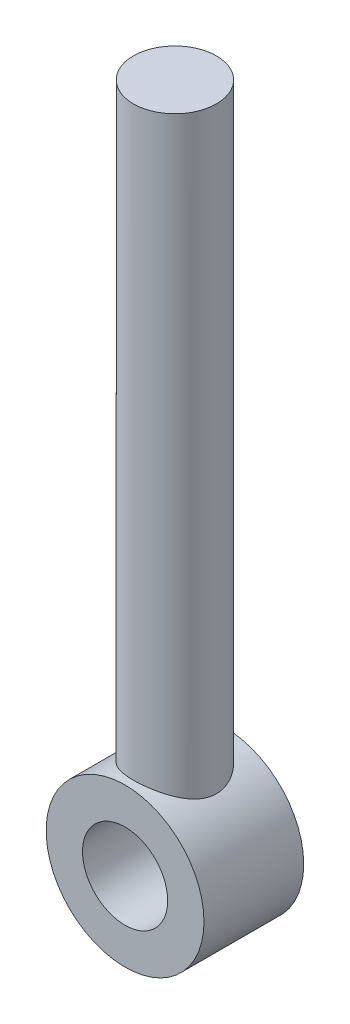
ISO-10303-21;
HEADER;
FILE_DESCRIPTION(('STEP AP214'),'2;1');
FILE_NAME('part.step','',(''),(''),'','','');
FILE_SCHEMA(('AUTOMOTIVE_DESIGN { 1 0 10303 214 1 1 1 1 }'));
ENDSEC;
DATA;
#1=APPLICATION_CONTEXT('core data for automotive mechanical design processes');
#2=APPLICATION_PROTOCOL_DEFINITION('international standard','automotive_design',2000,#1);
#3=PRODUCT_CONTEXT('',#1,'mechanical');
#4=PRODUCT('Part','Part','',(#3));
#5=PRODUCT_RELATED_PRODUCT_CATEGORY('part','',(#4));
#6=PRODUCT_DEFINITION_FORMATION('','',#4);
#7=PRODUCT_DEFINITION_CONTEXT('part definition',#1,'design');
#8=PRODUCT_DEFINITION('design','',#6,#7);
#9=PRODUCT_DEFINITION_SHAPE('','',#8);
#10=(LENGTH_UNIT() NAMED_UNIT(*) SI_UNIT(.MILLI.,.METRE.));
#11=(NAMED_UNIT(*) PLANE_ANGLE_UNIT() SI_UNIT($,.RADIAN.));
#12=(NAMED_UNIT(*) SI_UNIT($,.STERADIAN.) SOLID_ANGLE_UNIT());
#13=UNCERTAINTY_MEASURE_WITH_UNIT(LENGTH_MEASURE(1.E-05),#10,'distance_accuracy_value','');
#14=(GEOMETRIC_REPRESENTATION_CONTEXT(3) GLOBAL_UNCERTAINTY_ASSIGNED_CONTEXT((#13)) GLOBAL_UNIT_ASSIGNED_CONTEXT((#10,
#11,#12)) REPRESENTATION_CONTEXT('',''));
#15=CARTESIAN_POINT('',(0.,0.,0.));
#16=DIRECTION('',(0.,0.,1.));
#17=DIRECTION('',(1.,0.,0.));
#18=AXIS2_PLACEMENT_3D('',#15,#16,#17);
#19=CARTESIAN_POINT('',(0.,-12.7,-9.525));
#20=DIRECTION('',(0.,0.,1.));
#21=DIRECTION('',(1.,0.,0.));
#22=AXIS2_PLACEMENT_3D('',#19,#20,#21);
#23=CYLINDRICAL_SURFACE('',#22,15.08125);
#24=CARTESIAN_POINT('',(0.,-12.7,9.525));
#25=DIRECTION('',(0.,0.,1.));
#26=DIRECTION('',(1.,0.,0.));
#27=AXIS2_PLACEMENT_3D('',#24,#25,#26);
#28=CIRCLE('',#27,15.08125);
#29=CARTESIAN_POINT('',(15.08125,-12.7,9.525));
#30=VERTEX_POINT('',#29);
#31=EDGE_CURVE('E54',#30,#30,#28,.T.);
#32=ORIENTED_EDGE('',*,*,#31,.F.);
#33=EDGE_LOOP('',(#32));
#34=FACE_BOUND('',#33,.T.);
#35=CARTESIAN_POINT('',(0.,-12.7,-9.525));
#36=DIRECTION('',(0.,0.,1.));
#37=DIRECTION('',(1.,0.,0.));
#38=AXIS2_PLACEMENT_3D('',#35,#36,#37);
#39=CIRCLE('',#38,15.08125);
#40=CARTESIAN_POINT('',(15.08125,-12.7,-9.525));
#41=VERTEX_POINT('',#40);
#42=EDGE_CURVE('E47',#41,#41,#39,.T.);
#43=ORIENTED_EDGE('',*,*,#42,.T.);
#44=EDGE_LOOP('',(#43));
#45=FACE_BOUND('',#44,.T.);
#46=CARTESIAN_POINT('',(0.,2.38124999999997,-7.9375));
#47=CARTESIAN_POINT('',(-0.207394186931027,2.38125040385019,-7.93750049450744));
#48=CARTESIAN_POINT('',(-0.414782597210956,2.37696275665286,-7.92936320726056));
#49=CARTESIAN_POINT('',(-0.828014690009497,2.35992263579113,-7.89691493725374));
#50=CARTESIAN_POINT('',(-1.03385778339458,2.34716708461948,-7.87259807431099));
#51=CARTESIAN_POINT('',(-1.44260073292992,2.31349757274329,-7.80805173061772));
#52=CARTESIAN_POINT('',(-1.64549681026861,2.29257395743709,-7.7678034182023));
#53=CARTESIAN_POINT('',(-2.04672691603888,2.24308855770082,-7.67185684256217));
#54=CARTESIAN_POINT('',(-2.24505904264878,2.2145236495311,-7.61615226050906));
#55=CARTESIAN_POINT('',(-2.63491366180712,2.15059475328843,-7.49018721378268));
#56=CARTESIAN_POINT('',(-2.82646261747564,2.11526170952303,-7.41999288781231));
#57=CARTESIAN_POINT('',(-3.20259508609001,2.03853448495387,-7.26558126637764));
#58=CARTESIAN_POINT('',(-3.38717606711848,1.99713812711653,-7.1813589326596));
#59=CARTESIAN_POINT('',(-3.92877765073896,1.86524976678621,-6.90881639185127));
#60=CARTESIAN_POINT('',(-4.27405558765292,1.76699022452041,-6.7004903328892));
#61=CARTESIAN_POINT('',(-4.94790708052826,1.55116303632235,-6.22126354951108));
#62=CARTESIAN_POINT('',(-5.27394005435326,1.43275593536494,-5.94717795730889));
#63=CARTESIAN_POINT('',(-5.72656002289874,1.25267514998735,-5.50049825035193));
#64=CARTESIAN_POINT('',(-5.87145684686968,1.19219018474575,-5.34555005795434));
#65=CARTESIAN_POINT('',(-6.14854891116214,1.07179123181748,-5.02436250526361));
#66=CARTESIAN_POINT('',(-6.28074192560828,1.01187734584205,-4.85812117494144));
#67=CARTESIAN_POINT('',(-6.54281317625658,0.888910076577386,-4.49989226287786));
#68=CARTESIAN_POINT('',(-6.67144914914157,0.826048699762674,-4.30692847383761));
#69=CARTESIAN_POINT('',(-6.91183439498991,0.704803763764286,-3.90952046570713));
#70=CARTESIAN_POINT('',(-7.02359075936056,0.646418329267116,-3.70508111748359));
#71=CARTESIAN_POINT('',(-7.22924412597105,0.536153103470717,-3.28579312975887));
#72=CARTESIAN_POINT('',(-7.32314701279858,0.484271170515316,-3.07094794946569));
#73=CARTESIAN_POINT('',(-7.49206601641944,0.389020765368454,-2.63212910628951));
#74=CARTESIAN_POINT('',(-7.56708444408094,0.345651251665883,-2.40815656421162));
#75=CARTESIAN_POINT('',(-7.6931561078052,0.271679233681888,-1.96687473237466));
#76=CARTESIAN_POINT('',(-7.74540656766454,0.240452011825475,-1.75001291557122));
#77=CARTESIAN_POINT('',(-7.83160147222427,0.188470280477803,-1.31143209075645));
#78=CARTESIAN_POINT('',(-7.86554678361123,0.167715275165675,-1.08971331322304));
#79=CARTESIAN_POINT('',(-7.91453790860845,0.137640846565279,-0.643651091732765));
#80=CARTESIAN_POINT('',(-7.92960310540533,0.128309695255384,-0.419310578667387));
#81=CARTESIAN_POINT('',(-7.9406227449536,0.121492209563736,0.0300080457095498));
#82=CARTESIAN_POINT('',(-7.93657938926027,0.124004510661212,0.254986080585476));
#83=CARTESIAN_POINT('',(-7.91132031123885,0.139598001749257,0.672716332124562));
#84=CARTESIAN_POINT('',(-7.89252309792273,0.151190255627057,0.865676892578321));
#85=CARTESIAN_POINT('',(-7.84098674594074,0.18269935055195,1.2491027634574));
#86=CARTESIAN_POINT('',(-7.80824306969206,0.202618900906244,1.43956724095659));
#87=CARTESIAN_POINT('',(-7.72921466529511,0.250114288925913,1.81666250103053));
#88=CARTESIAN_POINT('',(-7.68293100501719,0.277689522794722,2.00329358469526));
#89=CARTESIAN_POINT('',(-7.57730353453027,0.339644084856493,2.37173405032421));
#90=CARTESIAN_POINT('',(-7.51795447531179,0.374026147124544,2.55354146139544));
#91=CARTESIAN_POINT('',(-7.38529913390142,0.449425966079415,2.91534096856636));
#92=CARTESIAN_POINT('',(-7.31171123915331,0.490574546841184,3.09520227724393));
#93=CARTESIAN_POINT('',(-7.15205829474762,0.577817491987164,3.44811460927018));
#94=CARTESIAN_POINT('',(-7.06598912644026,0.623913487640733,3.62116336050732));
#95=CARTESIAN_POINT('',(-6.88196115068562,0.719891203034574,3.95975400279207));
#96=CARTESIAN_POINT('',(-6.78400034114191,0.769773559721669,4.12529462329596));
#97=CARTESIAN_POINT('',(-6.57674863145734,0.872171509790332,4.44827008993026));
#98=CARTESIAN_POINT('',(-6.4674570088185,0.924687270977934,4.60570441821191));
#99=CARTESIAN_POINT('',(-6.22168528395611,1.03883585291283,4.93379435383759));
#100=CARTESIAN_POINT('',(-6.08355065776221,1.10070067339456,5.10313285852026));
#101=CARTESIAN_POINT('',(-5.7938748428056,1.22479607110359,5.42978641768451));
#102=CARTESIAN_POINT('',(-5.64233293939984,1.28702666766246,5.58710083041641));
#103=CARTESIAN_POINT('',(-5.32646473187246,1.41033769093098,5.88900925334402));
#104=CARTESIAN_POINT('',(-5.16213193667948,1.47141751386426,6.03359672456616));
#105=CARTESIAN_POINT('',(-4.82146501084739,1.59091194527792,6.30915082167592));
#106=CARTESIAN_POINT('',(-4.6451292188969,1.64932618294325,6.44011555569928));
#107=CARTESIAN_POINT('',(-4.2709149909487,1.76526522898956,6.69456893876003));
#108=CARTESIAN_POINT('',(-4.07238159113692,1.82254982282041,6.81720675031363));
#109=CARTESIAN_POINT('',(-3.66406217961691,1.93090355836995,7.04508248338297));
#110=CARTESIAN_POINT('',(-3.45428133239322,1.98197551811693,7.15032830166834));
#111=CARTESIAN_POINT('',(-3.02484600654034,2.07642422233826,7.34230893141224));
#112=CARTESIAN_POINT('',(-2.80519594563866,2.11980436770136,7.42905192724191));
#113=CARTESIAN_POINT('',(-2.35760575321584,2.19756235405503,7.58298003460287));
#114=CARTESIAN_POINT('',(-2.12966669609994,2.23194135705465,7.65016767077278));
#115=CARTESIAN_POINT('',(-1.68790767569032,2.28800105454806,7.75899170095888));
#116=CARTESIAN_POINT('',(-1.47462238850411,2.31053601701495,7.80236259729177));
#117=CARTESIAN_POINT('',(-1.04446183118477,2.34658661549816,7.87149588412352));
#118=CARTESIAN_POINT('',(-0.827586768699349,2.36010277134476,7.89725928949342));
#119=CARTESIAN_POINT('',(-0.392170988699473,2.37772391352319,7.93081121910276));
#120=CARTESIAN_POINT('',(-0.173631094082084,2.38183328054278,7.93860811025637));
#121=CARTESIAN_POINT('',(0.263312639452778,2.38053339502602,7.93613857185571));
#122=CARTESIAN_POINT('',(0.481716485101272,2.37512465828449,7.92587312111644));
#123=CARTESIAN_POINT('',(0.897313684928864,2.35584024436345,7.88912825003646));
#124=CARTESIAN_POINT('',(1.09467954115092,2.34275301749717,7.8641579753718));
#125=CARTESIAN_POINT('',(1.48642818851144,2.30910697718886,7.7996061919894));
#126=CARTESIAN_POINT('',(1.68080995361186,2.288545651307,7.76001976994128));
#127=CARTESIAN_POINT('',(2.06518186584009,2.24043614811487,7.66668338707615));
#128=CARTESIAN_POINT('',(2.25517342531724,2.2128902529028,7.61293805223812));
#129=CARTESIAN_POINT('',(2.62976260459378,2.15141397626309,7.49179713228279));
#130=CARTESIAN_POINT('',(2.81435809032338,2.11748110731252,7.42439622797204));
#131=CARTESIAN_POINT('',(3.18170393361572,2.04302748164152,7.27468162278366));
#132=CARTESIAN_POINT('',(3.3642880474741,2.00236116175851,7.1920323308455));
#133=CARTESIAN_POINT('',(3.72176867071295,1.91596427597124,7.01372091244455));
#134=CARTESIAN_POINT('',(3.89666255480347,1.87023199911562,6.91805438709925));
#135=CARTESIAN_POINT('',(4.40854109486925,1.72685604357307,6.61259821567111));
#136=CARTESIAN_POINT('',(4.73292149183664,1.62299134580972,6.38427020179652));
#137=CARTESIAN_POINT('',(5.37484577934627,1.39549969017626,5.85707040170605));
#138=CARTESIAN_POINT('',(5.6880369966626,1.27094446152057,5.55329138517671));
#139=CARTESIAN_POINT('',(6.11761900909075,1.08562023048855,5.06222173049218));
#140=CARTESIAN_POINT('',(6.25420466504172,1.02404862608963,4.89248275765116));
#141=CARTESIAN_POINT('',(6.51333581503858,0.902976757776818,4.54179172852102));
#142=CARTESIAN_POINT('',(6.6358790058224,0.843476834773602,4.36083784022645));
#143=CARTESIAN_POINT('',(6.87340686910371,0.724572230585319,3.97672861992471));
#144=CARTESIAN_POINT('',(6.98741688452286,0.665413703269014,3.77289316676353));
#145=CARTESIAN_POINT('',(7.19756616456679,0.553426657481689,3.35465065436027));
#146=CARTESIAN_POINT('',(7.29371405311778,0.50059508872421,3.14024876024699));
#147=CARTESIAN_POINT('',(7.46705987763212,0.403320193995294,2.70228305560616));
#148=CARTESIAN_POINT('',(7.5442745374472,0.358869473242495,2.47872753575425));
#149=CARTESIAN_POINT('',(7.67878518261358,0.280233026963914,2.02394697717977));
#150=CARTESIAN_POINT('',(7.73608462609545,0.246045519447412,1.79272327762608));
#151=CARTESIAN_POINT('',(7.82523454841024,0.192332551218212,1.34758159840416));
#152=CARTESIAN_POINT('',(7.85902730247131,0.171699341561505,1.13418553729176));
#153=CARTESIAN_POINT('',(7.90912147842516,0.140980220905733,0.704593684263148));
#154=CARTESIAN_POINT('',(7.92542414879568,0.130893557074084,0.488398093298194));
#155=CARTESIAN_POINT('',(7.94026335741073,0.121715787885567,0.0552791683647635));
#156=CARTESIAN_POINT('',(7.93880925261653,0.122618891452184,-0.161643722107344));
#157=CARTESIAN_POINT('',(7.91818152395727,0.135367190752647,-0.594311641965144));
#158=CARTESIAN_POINT('',(7.89900896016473,0.147211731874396,-0.810056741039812));
#159=CARTESIAN_POINT('',(7.84650775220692,0.17933349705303,-1.21354220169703));
#160=CARTESIAN_POINT('',(7.81508117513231,0.198471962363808,-1.40162570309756));
#161=CARTESIAN_POINT('',(7.7390047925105,0.244260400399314,-1.77422610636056));
#162=CARTESIAN_POINT('',(7.6943506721,0.270912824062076,-1.95874182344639));
#163=CARTESIAN_POINT('',(7.59229978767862,0.330908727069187,-2.32307353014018));
#164=CARTESIAN_POINT('',(7.53490439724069,0.364251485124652,-2.50289002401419));
#165=CARTESIAN_POINT('',(7.4078951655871,0.436686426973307,-2.85699488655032));
#166=CARTESIAN_POINT('',(7.33827648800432,0.475780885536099,-3.03128103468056));
#167=CARTESIAN_POINT('',(7.10209356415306,0.605563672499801,-3.56688597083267));
#168=CARTESIAN_POINT('',(6.91480321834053,0.704678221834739,-3.91725817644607));
#169=CARTESIAN_POINT('',(6.49213724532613,0.914395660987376,-4.58389307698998));
#170=CARTESIAN_POINT('',(6.2567357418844,1.02500471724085,-4.90013727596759));
#171=CARTESIAN_POINT('',(5.85300618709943,1.20007337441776,-5.36622673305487));
#172=CARTESIAN_POINT('',(5.69931167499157,1.26394393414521,-5.52918943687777));
#173=CARTESIAN_POINT('',(5.37849708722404,1.39062003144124,-5.84172864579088));
#174=CARTESIAN_POINT('',(5.21138102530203,1.45342588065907,-5.9913091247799));
#175=CARTESIAN_POINT('',(4.86436402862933,1.5764135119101,-6.27633069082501));
#176=CARTESIAN_POINT('',(4.68445328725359,1.63659322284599,-6.41176073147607));
#177=CARTESIAN_POINT('',(4.31280547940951,1.75274058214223,-6.66741965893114));
#178=CARTESIAN_POINT('',(4.1210670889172,1.80870775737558,-6.78764683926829));
#179=CARTESIAN_POINT('',(3.72274660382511,1.91604134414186,-7.01417308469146));
#180=CARTESIAN_POINT('',(3.51594044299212,1.96728957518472,-7.12013515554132));
#181=CARTESIAN_POINT('',(3.09250050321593,2.06237088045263,-7.31399569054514));
#182=CARTESIAN_POINT('',(2.87587162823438,2.10620760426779,-7.40190304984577));
#183=CARTESIAN_POINT('',(2.43472531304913,2.18510369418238,-7.55848415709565));
#184=CARTESIAN_POINT('',(2.21022513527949,2.22018104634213,-7.62719735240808));
#185=CARTESIAN_POINT('',(1.75488650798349,2.28055967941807,-7.74464426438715));
#186=CARTESIAN_POINT('',(1.5240517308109,2.30586650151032,-7.79338930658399));
#187=CARTESIAN_POINT('',(1.07831022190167,2.34416722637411,-7.86687107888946));
#188=CARTESIAN_POINT('',(0.863760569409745,2.35803937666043,-7.89332477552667));
#189=CARTESIAN_POINT('',(0.432805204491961,2.37658063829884,-7.92863914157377));
#190=CARTESIAN_POINT('',(0.21639945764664,2.38124957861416,-7.93749948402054));
#191=CARTESIAN_POINT('',(0.,2.38124999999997,-7.9375));
#192=B_SPLINE_CURVE_WITH_KNOTS('',3,(#46,#47,#48,#49,#50,#51,#52,#53,#54,#55,#56,#57,#58,#59,
#60,#61,#62,#63,#64,#65,#66,#67,#68,#69,#70,#71,#72,#73,#74,#75,#76,#77,#78,#79,#80,#81,#82,#83,
#84,#85,#86,#87,#88,#89,#90,#91,#92,#93,#94,#95,#96,#97,#98,#99,#100,#101,#102,#103,#104,#105,
#106,#107,#108,#109,#110,#111,#112,#113,#114,#115,#116,#117,#118,#119,#120,#121,#122,#123,#124,
#125,#126,#127,#128,#129,#130,#131,#132,#133,#134,#135,#136,#137,#138,#139,#140,#141,#142,#143,
#144,#145,#146,#147,#148,#149,#150,#151,#152,#153,#154,#155,#156,#157,#158,#159,#160,#161,#162,
#163,#164,#165,#166,#167,#168,#169,#170,#171,#172,#173,#174,#175,#176,#177,#178,#179,#180,#181,
#182,#183,#184,#185,#186,#187,#188,#189,#190,#191),.UNSPECIFIED.,.T.,.F.,(4,2,2,2,2,2,2,2,2,2,2,
2,2,2,2,2,2,2,2,2,2,2,2,2,2,2,2,2,2,2,2,2,2,2,2,2,2,2,2,2,2,2,2,2,2,2,2,2,2,2,2,2,2,2,2,2,2,2,2,
2,2,2,2,2,2,2,2,2,2,2,2,2,4),(0.,0.621970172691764,1.24416651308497,1.86710052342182,
2.4902895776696,3.11069459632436,3.73132292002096,4.97131934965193,6.29183494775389,
6.95308655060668,7.61445380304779,8.33440442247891,9.05405173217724,9.77346143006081,
10.4927830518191,11.1675188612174,11.8422227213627,12.5162333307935,13.1901662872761,
13.7721389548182,14.3543011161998,14.9364173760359,15.5187679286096,16.1140987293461,
16.7096264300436,17.3052545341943,17.9009206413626,18.5815488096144,19.2622132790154,
19.9432254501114,20.6243320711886,21.3442373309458,22.0638148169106,22.783073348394,
23.5022389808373,24.1577875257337,24.813298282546,25.4685037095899,26.1236736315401,
26.7210860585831,27.3186994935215,27.916117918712,28.5137695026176,29.1266165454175,
29.7396712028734,30.9651303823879,32.3202167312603,32.9988386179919,33.6775716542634,
34.3994208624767,35.1209206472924,35.8417808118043,36.5625157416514,37.2126905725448,
37.8628189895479,38.5126048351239,39.1623518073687,39.7366591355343,40.311154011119,
40.8855869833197,41.4602477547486,42.6835729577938,43.9075578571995,44.6056871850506,
45.3036085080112,46.0020706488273,46.7006111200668,47.4135065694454,48.1260499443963,
48.8371179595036,49.5477821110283,50.1967468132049,50.8457235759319),.UNSPECIFIED.);
#193=CARTESIAN_POINT('',(0.,2.38124999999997,-7.9375));
#194=VERTEX_POINT('',#193);
#195=EDGE_CURVE('E37',#194,#194,#192,.T.);
#196=ORIENTED_EDGE('',*,*,#195,.F.);
#197=EDGE_LOOP('',(#196));
#198=FACE_BOUND('',#197,.T.);
#199=ADVANCED_FACE('F32',(#34,#45,#198),#23,.T.);
#200=CARTESIAN_POINT('',(0.,-12.7,-9.525));
#201=DIRECTION('',(0.,0.,1.));
#202=DIRECTION('',(1.,0.,0.));
#203=AXIS2_PLACEMENT_3D('',#200,#201,#202);
#204=PLANE('',#203);
#205=CARTESIAN_POINT('',(0.,-12.7,-9.525));
#206=DIRECTION('',(0.,0.,1.));
#207=DIRECTION('',(1.,0.,0.));
#208=AXIS2_PLACEMENT_3D('',#205,#206,#207);
#209=CIRCLE('',#208,8.1359375);
#210=CARTESIAN_POINT('',(8.1359375,-12.7,-9.525));
#211=VERTEX_POINT('',#210);
#212=EDGE_CURVE('E51',#211,#211,#209,.T.);
#213=ORIENTED_EDGE('',*,*,#212,.T.);
#214=EDGE_LOOP('',(#213));
#215=FACE_BOUND('',#214,.T.);
#216=ORIENTED_EDGE('',*,*,#42,.F.);
#217=EDGE_LOOP('',(#216));
#218=FACE_BOUND('',#217,.T.);
#219=ADVANCED_FACE('F73',(#215,#218),#204,.F.);
#220=CARTESIAN_POINT('',(0.,-12.7,-9.525));
#221=DIRECTION('',(0.,0.,1.));
#222=DIRECTION('',(1.,0.,0.));
#223=AXIS2_PLACEMENT_3D('',#220,#221,#222);
#224=CYLINDRICAL_SURFACE('',#223,8.1359375);
#225=CARTESIAN_POINT('',(0.,-12.7,9.525));
#226=DIRECTION('',(0.,0.,1.));
#227=DIRECTION('',(1.,0.,0.));
#228=AXIS2_PLACEMENT_3D('',#225,#226,#227);
#229=CIRCLE('',#228,8.1359375);
#230=CARTESIAN_POINT('',(8.1359375,-12.7,9.525));
#231=VERTEX_POINT('',#230);
#232=EDGE_CURVE('E57',#231,#231,#229,.T.);
#233=CARTESIAN_POINT('',(8.1359375,-12.7,-9.525));
#234=CARTESIAN_POINT('',(8.1359375,-12.7,-9.3265625));
#235=CARTESIAN_POINT('',(8.1359375,-12.7,-9.128125));
#236=CARTESIAN_POINT('',(8.1359375,-12.7,-8.73125));
#237=CARTESIAN_POINT('',(8.1359375,-12.7,-8.5328125));
#238=CARTESIAN_POINT('',(8.1359375,-12.7,-8.1359375));
#239=CARTESIAN_POINT('',(8.1359375,-12.7,-7.9375));
#240=CARTESIAN_POINT('',(8.1359375,-12.7,-7.540625));
#241=CARTESIAN_POINT('',(8.1359375,-12.7,-7.3421875));
#242=CARTESIAN_POINT('',(8.1359375,-12.7,-6.9453125));
#243=CARTESIAN_POINT('',(8.1359375,-12.7,-6.746875));
#244=CARTESIAN_POINT('',(8.1359375,-12.7,-6.35));
#245=CARTESIAN_POINT('',(8.1359375,-12.7,-6.1515625));
#246=CARTESIAN_POINT('',(8.1359375,-12.7,-5.7546875));
#247=CARTESIAN_POINT('',(8.1359375,-12.7,-5.55625));
#248=CARTESIAN_POINT('',(8.1359375,-12.7,-5.159375));
#249=CARTESIAN_POINT('',(8.1359375,-12.7,-4.9609375));
#250=CARTESIAN_POINT('',(8.1359375,-12.7,-4.5640625));
#251=CARTESIAN_POINT('',(8.1359375,-12.7,-4.365625));
#252=CARTESIAN_POINT('',(8.1359375,-12.7,-3.96875));
#253=CARTESIAN_POINT('',(8.1359375,-12.7,-3.7703125));
#254=CARTESIAN_POINT('',(8.1359375,-12.7,-3.3734375));
#255=CARTESIAN_POINT('',(8.1359375,-12.7,-3.175));
#256=CARTESIAN_POINT('',(8.1359375,-12.7,-2.778125));
#257=CARTESIAN_POINT('',(8.1359375,-12.7,-2.5796875));
#258=CARTESIAN_POINT('',(8.1359375,-12.7,-2.1828125));
#259=CARTESIAN_POINT('',(8.1359375,-12.7,-1.984375));
#260=CARTESIAN_POINT('',(8.1359375,-12.7,-1.5875));
#261=CARTESIAN_POINT('',(8.1359375,-12.7,-1.3890625));
#262=CARTESIAN_POINT('',(8.1359375,-12.7,-0.992187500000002));
#263=CARTESIAN_POINT('',(8.1359375,-12.7,-0.793750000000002));
#264=CARTESIAN_POINT('',(8.1359375,-12.7,-0.396875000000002));
#265=CARTESIAN_POINT('',(8.1359375,-12.7,-0.198437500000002));
#266=CARTESIAN_POINT('',(8.1359375,-12.7,0.198437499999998));
#267=CARTESIAN_POINT('',(8.1359375,-12.7,0.396874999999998));
#268=CARTESIAN_POINT('',(8.1359375,-12.7,0.793749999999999));
#269=CARTESIAN_POINT('',(8.1359375,-12.7,0.992187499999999));
#270=CARTESIAN_POINT('',(8.1359375,-12.7,1.3890625));
#271=CARTESIAN_POINT('',(8.1359375,-12.7,1.5875));
#272=CARTESIAN_POINT('',(8.1359375,-12.7,1.984375));
#273=CARTESIAN_POINT('',(8.1359375,-12.7,2.1828125));
#274=CARTESIAN_POINT('',(8.1359375,-12.7,2.5796875));
#275=CARTESIAN_POINT('',(8.1359375,-12.7,2.778125));
#276=CARTESIAN_POINT('',(8.1359375,-12.7,3.175));
#277=CARTESIAN_POINT('',(8.1359375,-12.7,3.3734375));
#278=CARTESIAN_POINT('',(8.1359375,-12.7,3.7703125));
#279=CARTESIAN_POINT('',(8.1359375,-12.7,3.96875));
#280=CARTESIAN_POINT('',(8.1359375,-12.7,4.365625));
#281=CARTESIAN_POINT('',(8.1359375,-12.7,4.5640625));
#282=CARTESIAN_POINT('',(8.1359375,-12.7,4.9609375));
#283=CARTESIAN_POINT('',(8.1359375,-12.7,5.159375));
#284=CARTESIAN_POINT('',(8.1359375,-12.7,5.55625));
#285=CARTESIAN_POINT('',(8.1359375,-12.7,5.7546875));
#286=CARTESIAN_POINT('',(8.1359375,-12.7,6.1515625));
#287=CARTESIAN_POINT('',(8.1359375,-12.7,6.35));
#288=CARTESIAN_POINT('',(8.1359375,-12.7,6.746875));
#289=CARTESIAN_POINT('',(8.1359375,-12.7,6.9453125));
#290=CARTESIAN_POINT('',(8.1359375,-12.7,7.3421875));
#291=CARTESIAN_POINT('',(8.1359375,-12.7,7.540625));
#292=CARTESIAN_POINT('',(8.1359375,-12.7,7.9375));
#293=CARTESIAN_POINT('',(8.1359375,-12.7,8.1359375));
#294=CARTESIAN_POINT('',(8.1359375,-12.7,8.5328125));
#295=CARTESIAN_POINT('',(8.1359375,-12.7,8.73125));
#296=CARTESIAN_POINT('',(8.1359375,-12.7,9.128125));
#297=CARTESIAN_POINT('',(8.1359375,-12.7,9.3265625));
#298=CARTESIAN_POINT('',(8.1359375,-12.7,9.525));
#299=B_SPLINE_CURVE_WITH_KNOTS('',3,(#233,#234,#235,#236,#237,#238,#239,#240,#241,#242,#243,
#244,#245,#246,#247,#248,#249,#250,#251,#252,#253,#254,#255,#256,#257,#258,#259,#260,#261,#262,
#263,#264,#265,#266,#267,#268,#269,#270,#271,#272,#273,#274,#275,#276,#277,#278,#279,#280,#281,
#282,#283,#284,#285,#286,#287,#288,#289,#290,#291,#292,#293,#294,#295,#296,#297,#298),
.UNSPECIFIED.,.F.,.F.,(4,2,2,2,2,2,2,2,2,2,2,2,2,2,2,2,2,2,2,2,2,2,2,2,2,2,2,2,2,2,2,2,4),(0.,
0.5953125,1.190625,1.7859375,2.38125,2.9765625,3.571875,4.1671875,4.7625,5.3578125,5.953125,
6.5484375,7.14375,7.7390625,8.334375,8.9296875,9.525,10.1203125,10.715625,11.3109375,11.90625,
12.5015625,13.096875,13.6921875,14.2875,14.8828125,15.478125,16.0734375,16.66875,17.2640625,
17.859375,18.4546875,19.05),.UNSPECIFIED.);
#300=EDGE_CURVE('BSEAM61',#211,#231,#299,.T.);
#301=ORIENTED_EDGE('',*,*,#212,.F.);
#302=ORIENTED_EDGE('',*,*,#232,.T.);
#303=ORIENTED_EDGE('',*,*,#300,.T.);
#304=ORIENTED_EDGE('',*,*,#300,.F.);
#305=EDGE_LOOP('',(#301,#303,#302,#304));
#306=FACE_BOUND('',#305,.T.);
#307=ADVANCED_FACE('F61',(#306),#224,.F.);
#308=CARTESIAN_POINT('',(0.,-12.7,9.525));
#309=DIRECTION('',(0.,0.,1.));
#310=DIRECTION('',(1.,0.,0.));
#311=AXIS2_PLACEMENT_3D('',#308,#309,#310);
#312=PLANE('',#311);
#313=ORIENTED_EDGE('',*,*,#31,.T.);
#314=EDGE_LOOP('',(#313));
#315=FACE_BOUND('',#314,.T.);
#316=ORIENTED_EDGE('',*,*,#232,.F.);
#317=EDGE_LOOP('',(#316));
#318=FACE_BOUND('',#317,.T.);
#319=ADVANCED_FACE('F63',(#315,#318),#312,.T.);
#320=CARTESIAN_POINT('',(0.,114.3,0.));
#321=DIRECTION('',(0.,-1.,0.));
#322=DIRECTION('',(0.,0.,-1.));
#323=AXIS2_PLACEMENT_3D('',#320,#321,#322);
#324=CYLINDRICAL_SURFACE('',#323,7.9375);
#325=ORIENTED_EDGE('',*,*,#195,.T.);
#326=EDGE_LOOP('',(#325));
#327=FACE_BOUND('',#326,.T.);
#328=CARTESIAN_POINT('',(0.,114.3,0.));
#329=DIRECTION('',(0.,1.,0.));
#330=DIRECTION('',(0.,0.,1.));
#331=AXIS2_PLACEMENT_3D('',#328,#329,#330);
#332=CIRCLE('',#331,7.9375);
#333=CARTESIAN_POINT('',(0.,114.3,7.9375));
#334=VERTEX_POINT('',#333);
#335=EDGE_CURVE('E10',#334,#334,#332,.T.);
#336=ORIENTED_EDGE('',*,*,#335,.F.);
#337=EDGE_LOOP('',(#336));
#338=FACE_BOUND('',#337,.T.);
#339=ADVANCED_FACE('F34',(#327,#338),#324,.T.);
#340=CARTESIAN_POINT('',(0.,114.3,0.));
#341=DIRECTION('',(0.,1.,0.));
#342=DIRECTION('',(0.,0.,1.));
#343=AXIS2_PLACEMENT_3D('',#340,#341,#342);
#344=PLANE('',#343);
#345=ORIENTED_EDGE('',*,*,#335,.T.);
#346=EDGE_LOOP('',(#345));
#347=FACE_BOUND('',#346,.T.);
#348=ADVANCED_FACE('F71',(#347),#344,.T.);
#349=CLOSED_SHELL('',(#199,#219,#307,#319,#339,#348));
#350=MANIFOLD_SOLID_BREP('B2',#349);
#351=ADVANCED_BREP_SHAPE_REPRESENTATION('',(#18,#350),#14);
#352=SHAPE_DEFINITION_REPRESENTATION(#9,#351);
ENDSEC;
END-ISO-10303-21;
